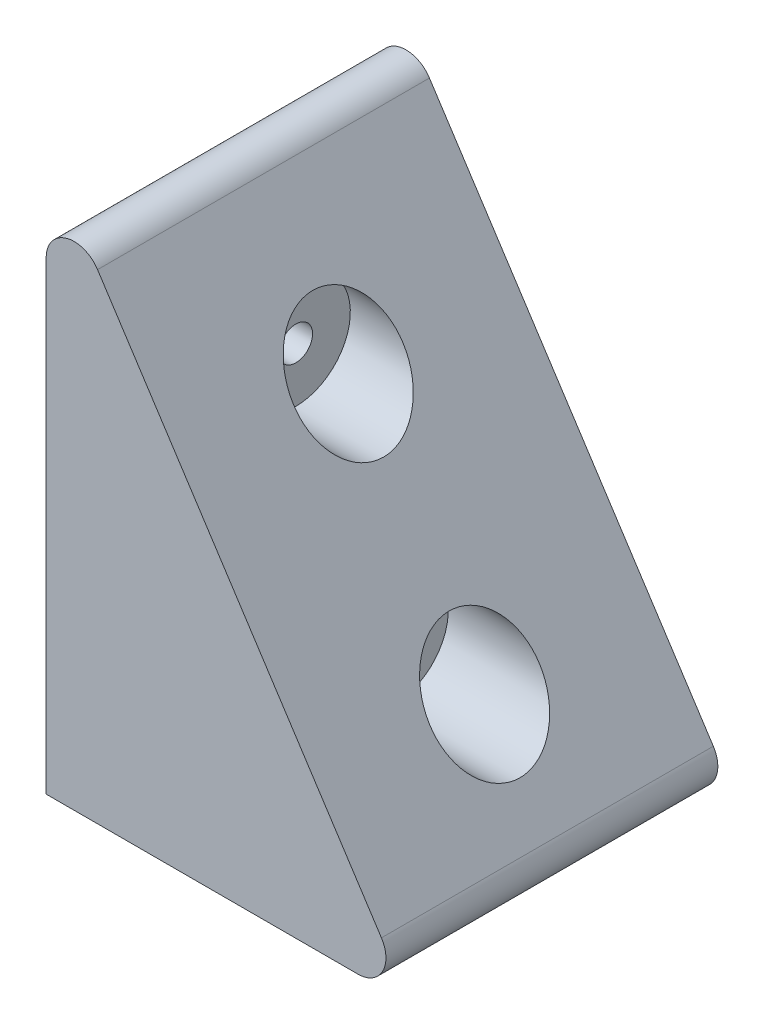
from build123d import *

# Parameters (mm, degrees)
BOSS_EXTRUDE1_DEPTH     = 30.1625
CUT_EXTRUDE1_DEPTH      = 3.81
CUT_EXTRUDE1_DEPTH_BACK = 25.4
SKETCH3_R               = 4.953
SKETCH4_R               = 1.524
CUT_EXTRUDE2_DEPTH      = 25.4
SKETCH5_R               = 4.953
CUT_EXTRUDE3_DEPTH      = 12.7
SKETCH6_R               = 1.524
CUT_EXTRUDE4_DEPTH      = 12.7


with BuildPart() as part:
    # Sketch2 → Boss-Extrude1 (new body)
    with BuildSketch(Plane.XY):
        with BuildLine():
            Line((0, 0), (28.339577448, 0))
            ThreePointArc((28.339577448, 0), (30.572025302, 1.328481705), (30.469224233, 3.924270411))
            Line((30.469224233, 3.924270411), (4.669646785, 43.615928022))
            ThreePointArc((4.669646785, 43.615928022), (1.818093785, 44.66690943), (0, 42.231657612))
            Line((0, 42.231657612), (0, 0))
        make_face()
    extrude(amount=BOSS_EXTRUDE1_DEPTH)

    # Sketch3 → Cut-Extrude1 (cut, two sides: drawn at the far end of the back side and taken through both)
    with BuildSketch(Plane.ZY.offset(-20.32).offset(-CUT_EXTRUDE1_DEPTH_BACK)):
        with Locations(Location((15.08125, 12.7, 0), (0, 0, 270))):
            Circle(SKETCH3_R)
    extrude(amount=CUT_EXTRUDE1_DEPTH + CUT_EXTRUDE1_DEPTH_BACK, mode=Mode.SUBTRACT)

    # Sketch4 → Cut-Extrude2 (cut)
    with BuildSketch(Plane(origin=(16.51, 0, 0), x_dir=(0, 0, -1), z_dir=(1, 0, 0))):
        with Locations((-15.08125, 12.7)):
            Circle(SKETCH4_R)
    extrude(amount=-CUT_EXTRUDE2_DEPTH, mode=Mode.SUBTRACT)

    # Sketch5 → Cut-Extrude3 (cut)
    with BuildSketch(Plane.ZY.offset(-20.32)):
        with Locations(Location((15.09323524, 31.75, 0), (0, 0, 270))):
            Circle(SKETCH5_R)
    extrude(amount=CUT_EXTRUDE3_DEPTH, mode=Mode.SUBTRACT)

    # Sketch6 → Cut-Extrude4 (cut)
    with BuildSketch(Plane(origin=(7.62, 0, 0), x_dir=(0, 0, -1), z_dir=(1, 0, 0))):
        with Locations((-15.09323524, 31.75)):
            Circle(SKETCH6_R)
    extrude(amount=-CUT_EXTRUDE4_DEPTH, mode=Mode.SUBTRACT)


solid = part.part
